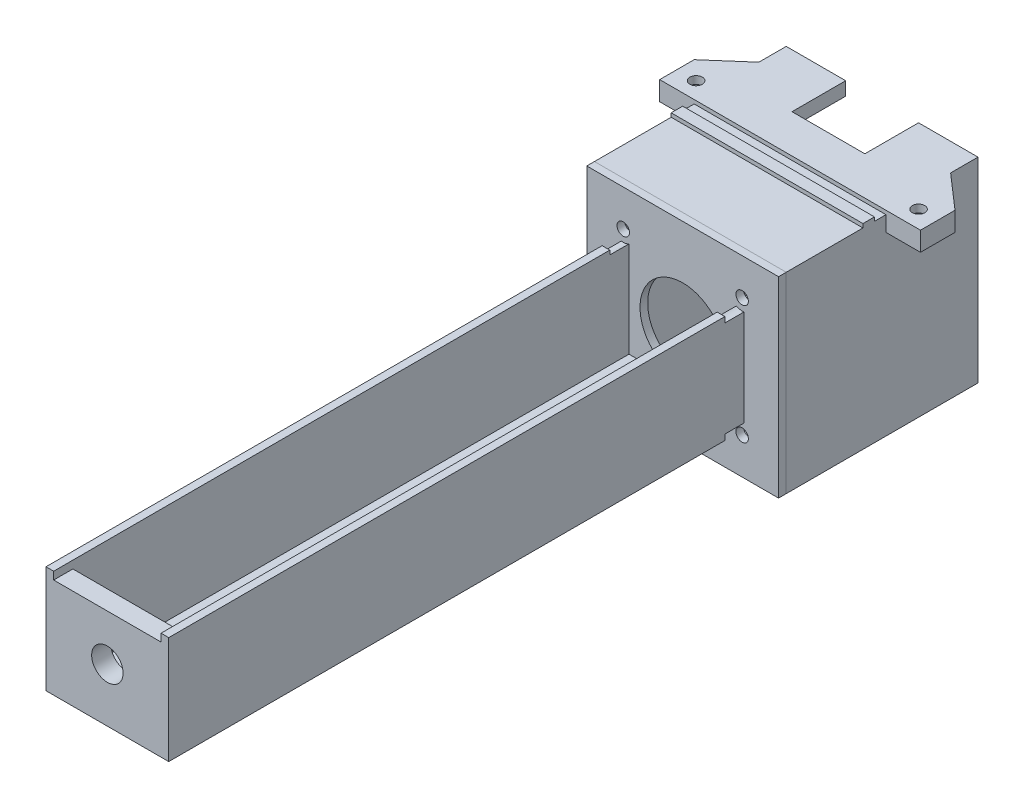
from build123d import *

# Parameters (mm, degrees)
CROQUIS1_W              = 50
CROQUIS1_H              = 50
CROQUIS1_W_2            = 45
CROQUIS1_H_2            = 45
SALIENTE_EXTRUIR1_DEPTH = 50
CROQUIS2_W              = 50
CROQUIS2_H              = 50
CROQUIS2_R              = 1.625
CROQUIS2_R_2            = 11.125
SALIENTE_EXTRUIR2_DEPTH = 2
SALIENTE_EXTRUIR3_DEPTH = 150
CROQUIS7_W              = 19
CROQUIS7_H              = 14
CORTAR_EXTRUIR1_DEPTH   = 4
CROQUIS8_W              = 50
CROQUIS8_H              = 3
SALIENTE_EXTRUIR4_DEPTH = 1
SALIENTE_EXTRUIR5_DEPTH = 5
CROQUIS10_R             = 3
CORTAR_EXTRUIR2_DEPTH   = 3
CROQUIS11_R             = 1.625
CORTAR_EXTRUIR3_DEPTH   = 5
CROQUIS13_W             = 28
CROQUIS13_H             = 24
CROQUIS13_R             = 4.1
SALIENTE_EXTRUIR6_DEPTH = 5
CROQUIS15_R             = 3
CORTAR_EXTRUIR4_DEPTH   = 5


with BuildPart() as part:
    # Croquis1 → Saliente-Extruir1 (new body)
    with BuildSketch(Plane.XY):
        Rectangle(CROQUIS1_W, CROQUIS1_H)
        Rectangle(CROQUIS1_W_2, CROQUIS1_H_2, mode=Mode.SUBTRACT)
    extrude(amount=SALIENTE_EXTRUIR1_DEPTH)

    # Croquis7 → Cortar-Extruir1 (cut)
    with BuildSketch(Plane(origin=(0, 25, 0), x_dir=(1, 0, 0), z_dir=(0, 1, 0))):
        with Locations((0, -7)):
            Rectangle(CROQUIS7_W, CROQUIS7_H)
    extrude(amount=-CORTAR_EXTRUIR1_DEPTH, mode=Mode.SUBTRACT)

    # Croquis8 → Saliente-Extruir4 (add)
    with BuildSketch(Plane(origin=(0, 25, 0), x_dir=(1, 0, 0), z_dir=(0, 1, 0))):
        Polygon((-9.5, -14), (9.5, -14), (9.5, 0), (25, 0), (25, -14), (25, -24), (-25, -24), (-25, -14), (-25, 0), (-9.5, 0), align=None)
        with Locations((0, -28.5)):
            Rectangle(CROQUIS8_W, CROQUIS8_H)
    extrude(amount=SALIENTE_EXTRUIR4_DEPTH)

    # Croquis9 → Saliente-Extruir5 (add)
    with BuildSketch(Plane(origin=(0, 26, 0), x_dir=(1, 0, 0), z_dir=(0, 1, 0))):
        Polygon((-34, -15), (-25, -7.137723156), (-25, -15), (-25, -24), (-34, -24), align=None)
        Polygon((25, -24), (34, -24), (34, -15), (25, -7.137723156), (25, -15), align=None)
    extrude(amount=-SALIENTE_EXTRUIR5_DEPTH)

    # Croquis10 → Cortar-Extruir2 (cut)
    with BuildSketch(Plane.XZ.offset(-21)):
        with Locations(Location((29, 19.5, 0), (0, 0, 270))):
            Circle(CROQUIS10_R)
        with Locations(Location((-29, 19.5, 0), (0, 0, 270))):
            Circle(CROQUIS10_R)
    extrude(amount=-CORTAR_EXTRUIR2_DEPTH, mode=Mode.SUBTRACT)

    # Croquis11 → Cortar-Extruir3 (cut)
    with BuildSketch(Plane.XZ.offset(-24)):
        with Locations(Location((29, 19.5, 0), (0, 0, 270))):
            Circle(CROQUIS11_R)
        with Locations(Location((-29, 19.5, 0), (0, 0, 270))):
            Circle(CROQUIS11_R)
    extrude(amount=-CORTAR_EXTRUIR3_DEPTH, mode=Mode.SUBTRACT)


with BuildPart() as body_2:
    # Croquis2 → Saliente-Extruir2 (new body)
    with BuildSketch(Plane.XY.offset(50)):
        Rectangle(CROQUIS2_W, CROQUIS2_H)
        with Locations((-15.5, 15.5)):
            Circle(CROQUIS2_R, mode=Mode.SUBTRACT)
        with Locations((15.5, 15.5)):
            Circle(CROQUIS2_R, mode=Mode.SUBTRACT)
        with Locations((15.5, -15.5)):
            Circle(CROQUIS2_R, mode=Mode.SUBTRACT)
        with Locations((-15.5, -15.5)):
            Circle(CROQUIS2_R, mode=Mode.SUBTRACT)
        Circle(CROQUIS2_R_2, mode=Mode.SUBTRACT)
    extrude(amount=SALIENTE_EXTRUIR2_DEPTH)

    # Croquis4 → Saliente-Extruir3 (add)
    with BuildSketch(Plane.XY.offset(52)):
        Polygon((-16, 14), (-16, -14), (16, -14), (16, 14), (14, 14), (14, -12), (-14, -12), (-14, 14), align=None)
    extrude(amount=SALIENTE_EXTRUIR3_DEPTH)

    # Croquis13 → Saliente-Extruir6 (add)
    with BuildSketch(Plane.XY.offset(202)):
        Rectangle(CROQUIS13_W, CROQUIS13_H)
        Circle(CROQUIS13_R, mode=Mode.SUBTRACT)
    extrude(amount=-SALIENTE_EXTRUIR6_DEPTH)

    # Croquis15 → Cortar-Extruir4 (cut)
    with BuildSketch(Plane.XY.offset(52)):
        with Locations((-15.5, 15.5)):
            Circle(CROQUIS15_R)
        with Locations((15.5, 15.5)):
            Circle(CROQUIS15_R)
        with Locations((15.5, -15.5)):
            Circle(CROQUIS15_R)
        with Locations((-15.5, -15.5)):
            Circle(CROQUIS15_R)
    extrude(amount=CORTAR_EXTRUIR4_DEPTH, mode=Mode.SUBTRACT)


solid = Compound([part.part, body_2.part])
